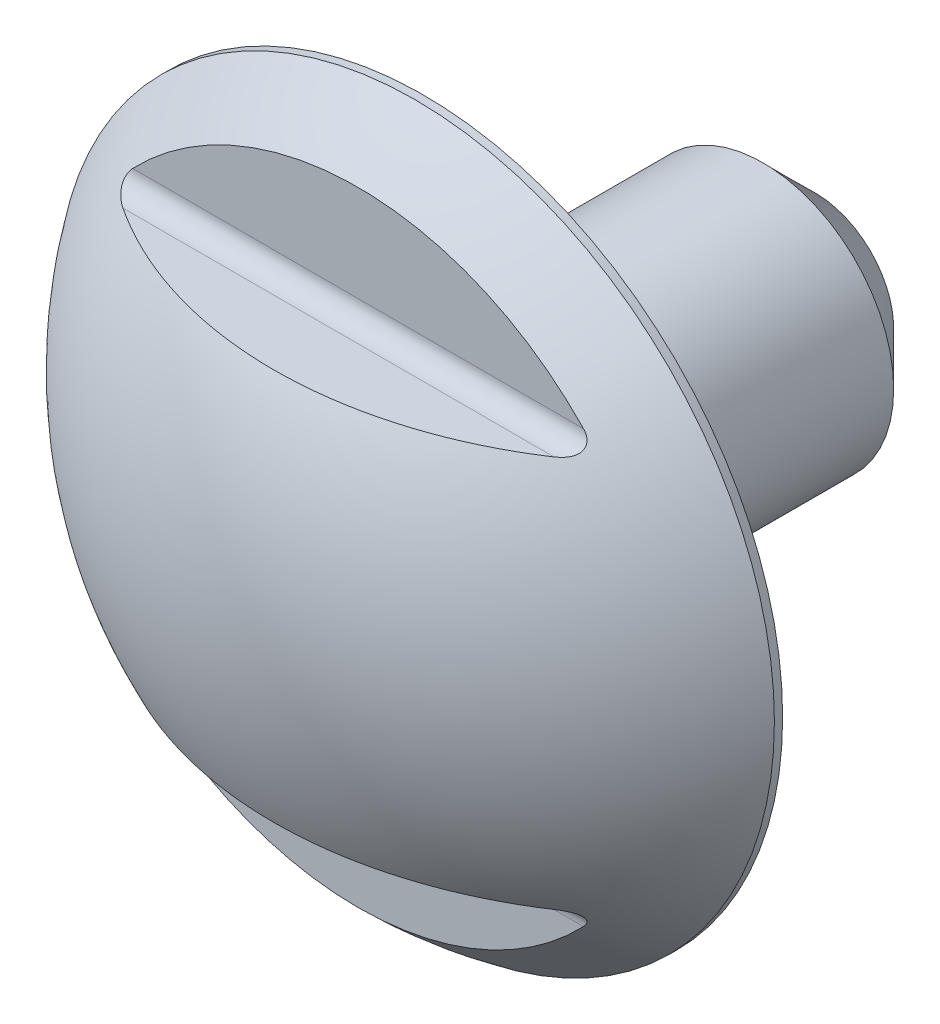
ISO-10303-21;
HEADER;
FILE_DESCRIPTION(('STEP AP214'),'2;1');
FILE_NAME('part.step','',(''),(''),'','','');
FILE_SCHEMA(('AUTOMOTIVE_DESIGN { 1 0 10303 214 1 1 1 1 }'));
ENDSEC;
DATA;
#1=APPLICATION_CONTEXT('core data for automotive mechanical design processes');
#2=APPLICATION_PROTOCOL_DEFINITION('international standard','automotive_design',2000,#1);
#3=PRODUCT_CONTEXT('',#1,'mechanical');
#4=PRODUCT('Part','Part','',(#3));
#5=PRODUCT_RELATED_PRODUCT_CATEGORY('part','',(#4));
#6=PRODUCT_DEFINITION_FORMATION('','',#4);
#7=PRODUCT_DEFINITION_CONTEXT('part definition',#1,'design');
#8=PRODUCT_DEFINITION('design','',#6,#7);
#9=PRODUCT_DEFINITION_SHAPE('','',#8);
#10=(LENGTH_UNIT() NAMED_UNIT(*) SI_UNIT(.MILLI.,.METRE.));
#11=(NAMED_UNIT(*) PLANE_ANGLE_UNIT() SI_UNIT($,.RADIAN.));
#12=(NAMED_UNIT(*) SI_UNIT($,.STERADIAN.) SOLID_ANGLE_UNIT());
#13=UNCERTAINTY_MEASURE_WITH_UNIT(LENGTH_MEASURE(1.E-05),#10,'distance_accuracy_value','');
#14=(GEOMETRIC_REPRESENTATION_CONTEXT(3) GLOBAL_UNCERTAINTY_ASSIGNED_CONTEXT((#13)) GLOBAL_UNIT_ASSIGNED_CONTEXT((#10,
#11,#12)) REPRESENTATION_CONTEXT('',''));
#15=CARTESIAN_POINT('',(0.,0.,0.));
#16=DIRECTION('',(0.,0.,1.));
#17=DIRECTION('',(1.,0.,0.));
#18=AXIS2_PLACEMENT_3D('',#15,#16,#17);
#19=CARTESIAN_POINT('',(0.,0.,-6.));
#20=DIRECTION('',(0.,0.,-1.));
#21=DIRECTION('',(1.,0.,0.));
#22=AXIS2_PLACEMENT_3D('',#19,#20,#21);
#23=CYLINDRICAL_SURFACE('',#22,5.5);
#24=CARTESIAN_POINT('',(0.,0.,0.));
#25=DIRECTION('',(0.,0.,-1.));
#26=DIRECTION('',(1.,0.,0.));
#27=AXIS2_PLACEMENT_3D('',#24,#25,#26);
#28=CIRCLE('',#27,5.5);
#29=CARTESIAN_POINT('',(5.5,0.,0.));
#30=VERTEX_POINT('',#29);
#31=EDGE_CURVE('E59',#30,#30,#28,.T.);
#32=ORIENTED_EDGE('',*,*,#31,.F.);
#33=EDGE_LOOP('',(#32));
#34=FACE_BOUND('',#33,.T.);
#35=CARTESIAN_POINT('',(0.,0.,0.126225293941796));
#36=DIRECTION('',(0.,0.,1.));
#37=DIRECTION('',(-1.,0.,0.));
#38=AXIS2_PLACEMENT_3D('',#35,#36,#37);
#39=CIRCLE('',#38,5.5);
#40=CARTESIAN_POINT('',(-5.5,0.,0.126225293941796));
#41=VERTEX_POINT('',#40);
#42=EDGE_CURVE('E176',#41,#41,#39,.T.);
#43=ORIENTED_EDGE('',*,*,#42,.F.);
#44=EDGE_LOOP('',(#43));
#45=FACE_BOUND('',#44,.T.);
#46=ADVANCED_FACE('F14',(#34,#45),#23,.T.);
#47=CARTESIAN_POINT('',(0.,-5.5,0.));
#48=DIRECTION('',(0.,0.,1.));
#49=DIRECTION('',(-1.,0.,0.));
#50=AXIS2_PLACEMENT_3D('',#47,#48,#49);
#51=PLANE('',#50);
#52=CARTESIAN_POINT('',(0.,0.,0.));
#53=DIRECTION('',(0.,0.,-1.));
#54=DIRECTION('',(1.,0.,0.));
#55=AXIS2_PLACEMENT_3D('',#52,#53,#54);
#56=CIRCLE('',#55,1.85);
#57=CARTESIAN_POINT('',(1.85,0.,0.));
#58=VERTEX_POINT('',#57);
#59=EDGE_CURVE('E195',#58,#58,#56,.T.);
#60=ORIENTED_EDGE('',*,*,#59,.F.);
#61=EDGE_LOOP('',(#60));
#62=FACE_BOUND('',#61,.T.);
#63=ORIENTED_EDGE('',*,*,#31,.T.);
#64=EDGE_LOOP('',(#63));
#65=FACE_BOUND('',#64,.T.);
#66=ADVANCED_FACE('F106',(#62,#65),#51,.F.);
#67=CARTESIAN_POINT('',(0.,0.,-0.4));
#68=DIRECTION('',(0.,0.,-1.));
#69=DIRECTION('',(1.,0.,0.));
#70=AXIS2_PLACEMENT_3D('',#67,#68,#69);
#71=TOROIDAL_SURFACE('',#70,1.85,0.4);
#72=CARTESIAN_POINT('',(0.,0.,-0.4));
#73=DIRECTION('',(0.,0.,-1.));
#74=DIRECTION('',(1.,0.,0.));
#75=AXIS2_PLACEMENT_3D('',#72,#73,#74);
#76=CIRCLE('',#75,1.45);
#77=CARTESIAN_POINT('',(1.45,0.,-0.4));
#78=VERTEX_POINT('',#77);
#79=EDGE_CURVE('E192',#78,#78,#76,.T.);
#80=ORIENTED_EDGE('',*,*,#79,.F.);
#81=EDGE_LOOP('',(#80));
#82=FACE_BOUND('',#81,.T.);
#83=ORIENTED_EDGE('',*,*,#59,.T.);
#84=EDGE_LOOP('',(#83));
#85=FACE_BOUND('',#84,.T.);
#86=ADVANCED_FACE('F111',(#82,#85),#71,.F.);
#87=CARTESIAN_POINT('',(0.,0.,-6.));
#88=DIRECTION('',(0.,0.,-1.));
#89=DIRECTION('',(1.,0.,0.));
#90=AXIS2_PLACEMENT_3D('',#87,#88,#89);
#91=CYLINDRICAL_SURFACE('',#90,1.45);
#92=CARTESIAN_POINT('',(0.,0.,-0.440192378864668));
#93=DIRECTION('',(0.,0.,-1.));
#94=DIRECTION('',(1.,0.,0.));
#95=AXIS2_PLACEMENT_3D('',#92,#93,#94);
#96=CIRCLE('',#95,1.45);
#97=CARTESIAN_POINT('',(1.45,0.,-0.440192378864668));
#98=VERTEX_POINT('',#97);
#99=EDGE_CURVE('E189',#98,#98,#96,.T.);
#100=ORIENTED_EDGE('',*,*,#99,.F.);
#101=EDGE_LOOP('',(#100));
#102=FACE_BOUND('',#101,.T.);
#103=ORIENTED_EDGE('',*,*,#79,.T.);
#104=EDGE_LOOP('',(#103));
#105=FACE_BOUND('',#104,.T.);
#106=ADVANCED_FACE('F119',(#102,#105),#91,.T.);
#107=CARTESIAN_POINT('',(0.,0.,-0.44019237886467));
#108=DIRECTION('',(0.,0.,-1.));
#109=DIRECTION('',(1.,0.,0.));
#110=AXIS2_PLACEMENT_3D('',#107,#108,#109);
#111=TOROIDAL_SURFACE('',#110,1.85,0.399999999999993);
#112=CARTESIAN_POINT('',(0.,0.,-0.640192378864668));
#113=DIRECTION('',(0.,0.,-1.));
#114=DIRECTION('',(1.,0.,0.));
#115=AXIS2_PLACEMENT_3D('',#112,#113,#114);
#116=CIRCLE('',#115,1.50358983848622);
#117=CARTESIAN_POINT('',(1.50358983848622,0.,-0.640192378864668));
#118=VERTEX_POINT('',#117);
#119=EDGE_CURVE('E186',#118,#118,#116,.T.);
#120=ORIENTED_EDGE('',*,*,#119,.F.);
#121=EDGE_LOOP('',(#120));
#122=FACE_BOUND('',#121,.T.);
#123=ORIENTED_EDGE('',*,*,#99,.T.);
#124=EDGE_LOOP('',(#123));
#125=FACE_BOUND('',#124,.T.);
#126=ADVANCED_FACE('F123',(#122,#125),#111,.F.);
#127=CARTESIAN_POINT('',(0.,0.,-0.640192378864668));
#128=DIRECTION('',(0.,0.,-1.));
#129=DIRECTION('',(1.,0.,0.));
#130=AXIS2_PLACEMENT_3D('',#127,#128,#129);
#131=CONICAL_SURFACE('',#130,1.50358983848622,0.523598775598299);
#132=CARTESIAN_POINT('',(0.,0.,-1.5));
#133=DIRECTION('',(0.,0.,-1.));
#134=DIRECTION('',(1.,0.,0.));
#135=AXIS2_PLACEMENT_3D('',#132,#133,#134);
#136=CIRCLE('',#135,2.);
#137=CARTESIAN_POINT('',(2.,0.,-1.5));
#138=VERTEX_POINT('',#137);
#139=EDGE_CURVE('E179',#138,#138,#136,.T.);
#140=ORIENTED_EDGE('',*,*,#139,.F.);
#141=EDGE_LOOP('',(#140));
#142=FACE_BOUND('',#141,.T.);
#143=ORIENTED_EDGE('',*,*,#119,.T.);
#144=EDGE_LOOP('',(#143));
#145=FACE_BOUND('',#144,.T.);
#146=ADVANCED_FACE('F127',(#142,#145),#131,.T.);
#147=CARTESIAN_POINT('',(0.,0.,-6.));
#148=DIRECTION('',(0.,0.,-1.));
#149=DIRECTION('',(1.,0.,0.));
#150=AXIS2_PLACEMENT_3D('',#147,#148,#149);
#151=CYLINDRICAL_SURFACE('',#150,2.);
#152=CARTESIAN_POINT('',(0.,0.,-5.2));
#153=DIRECTION('',(0.,0.,1.));
#154=DIRECTION('',(-1.,0.,0.));
#155=AXIS2_PLACEMENT_3D('',#152,#153,#154);
#156=CIRCLE('',#155,2.);
#157=CARTESIAN_POINT('',(-2.,0.,-5.2));
#158=VERTEX_POINT('',#157);
#159=EDGE_CURVE('E9',#158,#158,#156,.T.);
#160=ORIENTED_EDGE('',*,*,#159,.T.);
#161=EDGE_LOOP('',(#160));
#162=FACE_BOUND('',#161,.T.);
#163=ORIENTED_EDGE('',*,*,#139,.T.);
#164=EDGE_LOOP('',(#163));
#165=FACE_BOUND('',#164,.T.);
#166=ADVANCED_FACE('F131',(#162,#165),#151,.T.);
#167=CARTESIAN_POINT('',(0.,0.,-3.7));
#168=DIRECTION('',(0.,0.,1.));
#169=DIRECTION('',(0.,-1.,0.));
#170=AXIS2_PLACEMENT_3D('',#167,#168,#169);
#171=SPHERICAL_SURFACE('',#170,6.7);
#172=CARTESIAN_POINT('',(0.,3.,-3.7));
#173=DIRECTION('',(0.,-1.,0.));
#174=DIRECTION('',(0.,0.,1.));
#175=AXIS2_PLACEMENT_3D('',#172,#173,#174);
#176=CIRCLE('',#175,5.99082632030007);
#177=CARTESIAN_POINT('',(-3.3,3.,1.3));
#178=VERTEX_POINT('',#177);
#179=CARTESIAN_POINT('',(3.3,3.,1.3));
#180=VERTEX_POINT('',#179);
#181=EDGE_CURVE('E147',#178,#180,#176,.F.);
#182=ORIENTED_EDGE('',*,*,#181,.F.);
#183=CARTESIAN_POINT('',(-3.45089543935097,3.3002,1.00000006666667));
#184=CARTESIAN_POINT('',(-3.46018087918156,3.29048831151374,1.00000237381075));
#185=CARTESIAN_POINT('',(-3.46914612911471,3.28037875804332,1.00045993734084));
#186=CARTESIAN_POINT('',(-3.48611932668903,3.25927546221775,1.00258239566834));
#187=CARTESIAN_POINT('',(-3.49411182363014,3.24827117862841,1.0042643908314));
#188=CARTESIAN_POINT('',(-3.50706084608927,3.2278869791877,1.00865037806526));
#189=CARTESIAN_POINT('',(-3.51230406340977,3.21863403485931,1.01107565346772));
#190=CARTESIAN_POINT('',(-3.52144320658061,3.19986480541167,1.01703507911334));
#191=CARTESIAN_POINT('',(-3.52534582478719,3.19035009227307,1.0205635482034));
#192=CARTESIAN_POINT('',(-3.53092309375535,3.17302031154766,1.0280654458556));
#193=CARTESIAN_POINT('',(-3.53287341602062,3.16520988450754,1.03184218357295));
#194=CARTESIAN_POINT('',(-3.53549615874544,3.14978225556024,1.04017058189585));
#195=CARTESIAN_POINT('',(-3.53616853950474,3.1421650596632,1.04472226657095));
#196=CARTESIAN_POINT('',(-3.53617075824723,3.12736045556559,1.05449173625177));
#197=CARTESIAN_POINT('',(-3.53549939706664,3.12017343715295,1.05971011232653));
#198=CARTESIAN_POINT('',(-3.53287562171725,3.10643298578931,1.07063337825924));
#199=CARTESIAN_POINT('',(-3.53092247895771,3.09987991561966,1.07633854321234));
#200=CARTESIAN_POINT('',(-3.52529259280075,3.08604577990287,1.08944195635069));
#201=CARTESIAN_POINT('',(-3.52131606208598,3.07896325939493,1.0969197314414));
#202=CARTESIAN_POINT('',(-3.51201340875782,3.06596918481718,1.11203868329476));
#203=CARTESIAN_POINT('',(-3.50668549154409,3.06005920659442,1.11968006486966));
#204=CARTESIAN_POINT('',(-3.49206581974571,3.04659813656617,1.13880050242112));
#205=CARTESIAN_POINT('',(-3.48213266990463,3.03973031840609,1.1502644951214));
#206=CARTESIAN_POINT('',(-3.460749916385,3.02796447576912,1.1728760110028));
#207=CARTESIAN_POINT('',(-3.44929059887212,3.02307995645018,1.18402089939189));
#208=CARTESIAN_POINT('',(-3.42676990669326,3.0153950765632,1.20457526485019));
#209=CARTESIAN_POINT('',(-3.41581348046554,3.01241999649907,1.21403723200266));
#210=CARTESIAN_POINT('',(-3.39333574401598,3.00751675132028,1.23257885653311));
#211=CARTESIAN_POINT('',(-3.38181362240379,3.00559014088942,1.24165792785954));
#212=CARTESIAN_POINT('',(-3.35866326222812,3.00265798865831,1.25919687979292));
#213=CARTESIAN_POINT('',(-3.34704513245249,3.00163031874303,1.26766662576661));
#214=CARTESIAN_POINT('',(-3.32355151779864,3.00030227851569,1.28421487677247));
#215=CARTESIAN_POINT('',(-3.31167705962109,2.99999941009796,1.29229463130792));
#216=CARTESIAN_POINT('',(-3.29969688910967,3.00000006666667,1.3002));
#217=B_SPLINE_CURVE_WITH_KNOTS('',3,(#183,#184,#185,#186,#187,#188,#189,#190,#191,#192,#193,
#194,#195,#196,#197,#198,#199,#200,#201,#202,#203,#204,#205,#206,#207,#208,#209,#210,#211,#212,
#213,#214,#215,#216),.UNSPECIFIED.,.F.,.F.,(4,2,2,2,2,2,2,2,2,2,2,2,2,2,2,2,4),(0.,
0.0403974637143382,0.0813702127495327,0.113978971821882,0.146422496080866,0.172983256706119,
0.199544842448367,0.226130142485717,0.252730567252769,0.28566873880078,0.318650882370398,
0.368325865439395,0.418333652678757,0.462609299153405,0.506950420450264,0.550166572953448,
0.593233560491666),.UNSPECIFIED.);
#218=CARTESIAN_POINT('',(-3.45108678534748,3.3,1.));
#219=VERTEX_POINT('',#218);
#220=EDGE_CURVE('E157',#219,#178,#217,.T.);
#221=ORIENTED_EDGE('',*,*,#220,.F.);
#222=CARTESIAN_POINT('',(0.,0.,1.));
#223=DIRECTION('',(0.,0.,-1.));
#224=DIRECTION('',(0.,-1.,0.));
#225=AXIS2_PLACEMENT_3D('',#222,#223,#224);
#226=CIRCLE('',#225,4.77493455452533);
#227=CARTESIAN_POINT('',(3.45108678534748,3.3,1.));
#228=VERTEX_POINT('',#227);
#229=EDGE_CURVE('E73',#228,#219,#226,.F.);
#230=ORIENTED_EDGE('',*,*,#229,.F.);
#231=CARTESIAN_POINT('',(3.29969688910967,3.00000006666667,1.3002));
#232=CARTESIAN_POINT('',(3.31430711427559,3.00000454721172,1.29055614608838));
#233=CARTESIAN_POINT('',(3.32876926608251,3.00045317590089,1.28065091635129));
#234=CARTESIAN_POINT('',(3.35734920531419,3.00246823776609,1.26021193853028));
#235=CARTESIAN_POINT('',(3.37146290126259,3.00404436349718,1.24967347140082));
#236=CARTESIAN_POINT('',(3.39935085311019,3.00860290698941,1.22778339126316));
#237=CARTESIAN_POINT('',(3.41311009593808,3.01161648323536,1.21641873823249));
#238=CARTESIAN_POINT('',(3.43957104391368,3.01940778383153,1.19314330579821));
#239=CARTESIAN_POINT('',(3.45227673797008,3.02417844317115,1.18123487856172));
#240=CARTESIAN_POINT('',(3.47174047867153,3.03379937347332,1.1613999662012));
#241=CARTESIAN_POINT('',(3.47897095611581,3.03797889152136,1.15361468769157));
#242=CARTESIAN_POINT('',(3.49256263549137,3.0473758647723,1.13793714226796));
#243=CARTESIAN_POINT('',(3.49892598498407,3.05259067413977,1.1300451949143));
#244=CARTESIAN_POINT('',(3.51057224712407,3.06427793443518,1.11416825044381));
#245=CARTESIAN_POINT('',(3.51584074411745,3.07076521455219,1.1061833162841));
#246=CARTESIAN_POINT('',(3.52477894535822,3.08503547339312,1.09047194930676));
#247=CARTESIAN_POINT('',(3.52845172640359,3.09281591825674,1.08274504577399));
#248=CARTESIAN_POINT('',(3.53315073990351,3.10756914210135,1.06968936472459));
#249=CARTESIAN_POINT('',(3.53459973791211,3.11429041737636,1.06422885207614));
#250=CARTESIAN_POINT('',(3.53621492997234,3.1282846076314,1.05385062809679));
#251=CARTESIAN_POINT('',(3.53638173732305,3.13555725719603,1.04893265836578));
#252=CARTESIAN_POINT('',(3.53541714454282,3.15043972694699,1.03979236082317));
#253=CARTESIAN_POINT('',(3.53428616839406,3.15804943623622,1.03556980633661));
#254=CARTESIAN_POINT('',(3.5308278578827,3.17337877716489,1.02789576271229));
#255=CARTESIAN_POINT('',(3.52850021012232,3.18109843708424,1.02444447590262));
#256=CARTESIAN_POINT('',(3.52190588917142,3.19892583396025,1.01732823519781));
#257=CARTESIAN_POINT('',(3.51725673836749,3.20900531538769,1.01394983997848));
#258=CARTESIAN_POINT('',(3.50657915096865,3.22879085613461,1.0083911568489));
#259=CARTESIAN_POINT('',(3.50054441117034,3.23849496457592,1.00621650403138));
#260=CARTESIAN_POINT('',(3.48758435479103,3.25721720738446,1.00291628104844));
#261=CARTESIAN_POINT('',(3.48067533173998,3.26624400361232,1.00177403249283));
#262=CARTESIAN_POINT('',(3.46621678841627,3.28366499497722,1.0003205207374));
#263=CARTESIAN_POINT('',(3.45867581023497,3.29206540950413,0.999999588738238));
#264=CARTESIAN_POINT('',(3.45089543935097,3.3002,1.00000006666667));
#265=B_SPLINE_CURVE_WITH_KNOTS('',3,(#231,#232,#233,#234,#235,#236,#237,#238,#239,#240,#241,
#242,#243,#244,#245,#246,#247,#248,#249,#250,#251,#252,#253,#254,#255,#256,#257,#258,#259,#260,
#261,#262,#263,#264),.UNSPECIFIED.,.F.,.F.,(4,2,2,2,2,2,2,2,2,2,2,2,2,2,2,2,4),(0.,
0.0525412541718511,0.105539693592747,0.15974309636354,0.213730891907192,0.247920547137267,
0.28202392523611,0.316551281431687,0.351011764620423,0.377234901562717,0.403445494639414,
0.429647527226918,0.455856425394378,0.490472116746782,0.525248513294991,0.55945250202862,
0.593251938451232),.UNSPECIFIED.);
#266=EDGE_CURVE('E148',#180,#228,#265,.T.);
#267=ORIENTED_EDGE('',*,*,#266,.F.);
#268=EDGE_LOOP('',(#182,#221,#230,#267));
#269=FACE_BOUND('',#268,.T.);
#270=CARTESIAN_POINT('',(0.,0.,1.));
#271=DIRECTION('',(0.,0.,-1.));
#272=DIRECTION('',(0.,-1.,0.));
#273=AXIS2_PLACEMENT_3D('',#270,#271,#272);
#274=CIRCLE('',#273,4.77493455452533);
#275=CARTESIAN_POINT('',(-3.4510867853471,-3.3,1.));
#276=VERTEX_POINT('',#275);
#277=CARTESIAN_POINT('',(3.45108678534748,-3.3,1.));
#278=VERTEX_POINT('',#277);
#279=EDGE_CURVE('E71',#276,#278,#274,.F.);
#280=ORIENTED_EDGE('',*,*,#279,.F.);
#281=CARTESIAN_POINT('',(-3.29969688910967,-3.00000006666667,1.3002));
#282=CARTESIAN_POINT('',(-3.31430711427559,-3.00000454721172,1.29055614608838));
#283=CARTESIAN_POINT('',(-3.32876926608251,-3.00045317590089,1.2806509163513));
#284=CARTESIAN_POINT('',(-3.35734920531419,-3.00246823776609,1.26021193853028));
#285=CARTESIAN_POINT('',(-3.37146290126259,-3.00404436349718,1.24967347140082));
#286=CARTESIAN_POINT('',(-3.39935085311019,-3.00860290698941,1.22778339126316));
#287=CARTESIAN_POINT('',(-3.41311009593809,-3.01161648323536,1.21641873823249));
#288=CARTESIAN_POINT('',(-3.43957104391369,-3.01940778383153,1.1931433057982));
#289=CARTESIAN_POINT('',(-3.45227673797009,-3.02417844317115,1.18123487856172));
#290=CARTESIAN_POINT('',(-3.47174047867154,-3.03379937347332,1.16139996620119));
#291=CARTESIAN_POINT('',(-3.47897095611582,-3.03797889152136,1.15361468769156));
#292=CARTESIAN_POINT('',(-3.49256263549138,-3.04737586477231,1.13793714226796));
#293=CARTESIAN_POINT('',(-3.49892598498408,-3.05259067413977,1.1300451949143));
#294=CARTESIAN_POINT('',(-3.51057224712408,-3.06427793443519,1.1141682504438));
#295=CARTESIAN_POINT('',(-3.51584074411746,-3.07076521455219,1.10618331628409));
#296=CARTESIAN_POINT('',(-3.52477894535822,-3.08503547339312,1.09047194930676));
#297=CARTESIAN_POINT('',(-3.5284517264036,-3.09281591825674,1.08274504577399));
#298=CARTESIAN_POINT('',(-3.53315073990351,-3.10756914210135,1.06968936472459));
#299=CARTESIAN_POINT('',(-3.53459973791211,-3.11429041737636,1.06422885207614));
#300=CARTESIAN_POINT('',(-3.53621492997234,-3.1282846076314,1.05385062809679));
#301=CARTESIAN_POINT('',(-3.53638173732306,-3.13555725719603,1.04893265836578));
#302=CARTESIAN_POINT('',(-3.53541714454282,-3.150439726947,1.03979236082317));
#303=CARTESIAN_POINT('',(-3.53428616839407,-3.15804943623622,1.03556980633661));
#304=CARTESIAN_POINT('',(-3.5308278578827,-3.17337877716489,1.02789576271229));
#305=CARTESIAN_POINT('',(-3.52850021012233,-3.18109843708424,1.02444447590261));
#306=CARTESIAN_POINT('',(-3.52190588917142,-3.19892583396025,1.0173282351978));
#307=CARTESIAN_POINT('',(-3.5172567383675,-3.20900531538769,1.01394983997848));
#308=CARTESIAN_POINT('',(-3.50657915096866,-3.22879085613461,1.0083911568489));
#309=CARTESIAN_POINT('',(-3.50054441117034,-3.23849496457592,1.00621650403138));
#310=CARTESIAN_POINT('',(-3.48758435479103,-3.25721720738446,1.00291628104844));
#311=CARTESIAN_POINT('',(-3.48067533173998,-3.26624400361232,1.00177403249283));
#312=CARTESIAN_POINT('',(-3.46621678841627,-3.28366499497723,1.0003205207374));
#313=CARTESIAN_POINT('',(-3.45867581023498,-3.29206540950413,0.999999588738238));
#314=CARTESIAN_POINT('',(-3.45089543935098,-3.3002,1.00000006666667));
#315=B_SPLINE_CURVE_WITH_KNOTS('',3,(#281,#282,#283,#284,#285,#286,#287,#288,#289,#290,#291,
#292,#293,#294,#295,#296,#297,#298,#299,#300,#301,#302,#303,#304,#305,#306,#307,#308,#309,#310,
#311,#312,#313,#314),.UNSPECIFIED.,.F.,.F.,(4,2,2,2,2,2,2,2,2,2,2,2,2,2,2,2,4),(0.,
0.0525412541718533,0.105539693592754,0.159743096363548,0.213730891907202,0.247920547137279,
0.282023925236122,0.316551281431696,0.351011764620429,0.377234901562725,0.403445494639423,
0.429647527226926,0.455856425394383,0.490472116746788,0.525248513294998,0.559452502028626,
0.593251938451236),.UNSPECIFIED.);
#316=CARTESIAN_POINT('',(-3.3,-3.,1.3));
#317=VERTEX_POINT('',#316);
#318=EDGE_CURVE('E64',#317,#276,#315,.T.);
#319=ORIENTED_EDGE('',*,*,#318,.F.);
#320=CARTESIAN_POINT('',(0.,-3.,-3.7));
#321=DIRECTION('',(0.,1.,0.));
#322=DIRECTION('',(0.,0.,-1.));
#323=AXIS2_PLACEMENT_3D('',#320,#321,#322);
#324=CIRCLE('',#323,5.99082632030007);
#325=CARTESIAN_POINT('',(3.3,-3.,1.3));
#326=VERTEX_POINT('',#325);
#327=EDGE_CURVE('E53',#326,#317,#324,.F.);
#328=ORIENTED_EDGE('',*,*,#327,.F.);
#329=CARTESIAN_POINT('',(3.45089543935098,-3.3002,1.00000006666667));
#330=CARTESIAN_POINT('',(3.46018087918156,-3.29048831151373,1.00000237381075));
#331=CARTESIAN_POINT('',(3.46914612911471,-3.28037875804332,1.00045993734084));
#332=CARTESIAN_POINT('',(3.48611932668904,-3.25927546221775,1.00258239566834));
#333=CARTESIAN_POINT('',(3.49411182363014,-3.24827117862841,1.0042643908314));
#334=CARTESIAN_POINT('',(3.50706084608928,-3.2278869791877,1.00865037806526));
#335=CARTESIAN_POINT('',(3.51230406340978,-3.21863403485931,1.01107565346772));
#336=CARTESIAN_POINT('',(3.52144320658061,-3.19986480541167,1.01703507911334));
#337=CARTESIAN_POINT('',(3.52534582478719,-3.19035009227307,1.0205635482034));
#338=CARTESIAN_POINT('',(3.53092309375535,-3.17302031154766,1.0280654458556));
#339=CARTESIAN_POINT('',(3.53287341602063,-3.16520988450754,1.03184218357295));
#340=CARTESIAN_POINT('',(3.53549615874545,-3.14978225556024,1.04017058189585));
#341=CARTESIAN_POINT('',(3.53616853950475,-3.14216505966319,1.04472226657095));
#342=CARTESIAN_POINT('',(3.53617075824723,-3.12736045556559,1.05449173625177));
#343=CARTESIAN_POINT('',(3.53549939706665,-3.12017343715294,1.05971011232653));
#344=CARTESIAN_POINT('',(3.53287562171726,-3.10643298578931,1.07063337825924));
#345=CARTESIAN_POINT('',(3.53092247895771,-3.09987991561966,1.07633854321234));
#346=CARTESIAN_POINT('',(3.52529259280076,-3.08604577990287,1.08944195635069));
#347=CARTESIAN_POINT('',(3.52131606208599,-3.07896325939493,1.0969197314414));
#348=CARTESIAN_POINT('',(3.51201340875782,-3.06596918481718,1.11203868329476));
#349=CARTESIAN_POINT('',(3.50668549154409,-3.06005920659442,1.11968006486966));
#350=CARTESIAN_POINT('',(3.49206581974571,-3.04659813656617,1.13880050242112));
#351=CARTESIAN_POINT('',(3.48213266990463,-3.03973031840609,1.1502644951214));
#352=CARTESIAN_POINT('',(3.460749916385,-3.02796447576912,1.1728760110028));
#353=CARTESIAN_POINT('',(3.44929059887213,-3.02307995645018,1.18402089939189));
#354=CARTESIAN_POINT('',(3.42676990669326,-3.0153950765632,1.20457526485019));
#355=CARTESIAN_POINT('',(3.41581348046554,-3.01241999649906,1.21403723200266));
#356=CARTESIAN_POINT('',(3.39333574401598,-3.00751675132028,1.23257885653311));
#357=CARTESIAN_POINT('',(3.38181362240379,-3.00559014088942,1.24165792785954));
#358=CARTESIAN_POINT('',(3.35866326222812,-3.00265798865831,1.25919687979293));
#359=CARTESIAN_POINT('',(3.34704513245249,-3.00163031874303,1.26766662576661));
#360=CARTESIAN_POINT('',(3.32355151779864,-3.00030227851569,1.28421487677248));
#361=CARTESIAN_POINT('',(3.31167705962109,-2.99999941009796,1.29229463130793));
#362=CARTESIAN_POINT('',(3.29969688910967,-3.00000006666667,1.3002));
#363=B_SPLINE_CURVE_WITH_KNOTS('',3,(#329,#330,#331,#332,#333,#334,#335,#336,#337,#338,#339,
#340,#341,#342,#343,#344,#345,#346,#347,#348,#349,#350,#351,#352,#353,#354,#355,#356,#357,#358,
#359,#360,#361,#362),.UNSPECIFIED.,.F.,.F.,(4,2,2,2,2,2,2,2,2,2,2,2,2,2,2,2,4),(0.,
0.0403974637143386,0.0813702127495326,0.113978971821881,0.146422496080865,0.172983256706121,
0.199544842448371,0.226130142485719,0.252730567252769,0.28566873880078,0.318650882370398,
0.368325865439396,0.418333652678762,0.46260929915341,0.506950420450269,0.550166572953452,
0.593233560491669),.UNSPECIFIED.);
#364=EDGE_CURVE('E58',#278,#326,#363,.T.);
#365=ORIENTED_EDGE('',*,*,#364,.F.);
#366=EDGE_LOOP('',(#280,#319,#328,#365));
#367=FACE_BOUND('',#366,.T.);
#368=ORIENTED_EDGE('',*,*,#42,.T.);
#369=EDGE_LOOP('',(#368));
#370=FACE_BOUND('',#369,.T.);
#371=ADVANCED_FACE('F69',(#269,#367,#370),#171,.T.);
#372=CARTESIAN_POINT('',(10.,-3.3,1.));
#373=DIRECTION('',(0.,0.,-1.));
#374=DIRECTION('',(0.,-1.,0.));
#375=AXIS2_PLACEMENT_3D('',#372,#373,#374);
#376=PLANE('',#375);
#377=ORIENTED_EDGE('',*,*,#279,.T.);
#378=DIRECTION('',(-1.,0.,0.));
#379=VECTOR('',#378,1.);
#380=CARTESIAN_POINT('',(10.,-3.3,1.));
#381=LINE('',#380,#379);
#382=EDGE_CURVE('E66',#278,#276,#381,.T.);
#383=ORIENTED_EDGE('',*,*,#382,.T.);
#384=EDGE_LOOP('',(#377,#383));
#385=FACE_BOUND('',#384,.T.);
#386=ADVANCED_FACE('F93',(#385),#376,.F.);
#387=CARTESIAN_POINT('',(10.,-3.3,1.3));
#388=DIRECTION('',(-1.,0.,0.));
#389=DIRECTION('',(0.,-1.,0.));
#390=AXIS2_PLACEMENT_3D('',#387,#388,#389);
#391=CYLINDRICAL_SURFACE('',#390,0.3);
#392=ORIENTED_EDGE('',*,*,#318,.T.);
#393=ORIENTED_EDGE('',*,*,#382,.F.);
#394=ORIENTED_EDGE('',*,*,#364,.T.);
#395=DIRECTION('',(-1.,0.,0.));
#396=VECTOR('',#395,1.);
#397=CARTESIAN_POINT('',(10.,-3.,1.3));
#398=LINE('',#397,#396);
#399=EDGE_CURVE('E35',#326,#317,#398,.T.);
#400=ORIENTED_EDGE('',*,*,#399,.T.);
#401=EDGE_LOOP('',(#392,#393,#394,#400));
#402=FACE_BOUND('',#401,.T.);
#403=ADVANCED_FACE('F62',(#402),#391,.F.);
#404=CARTESIAN_POINT('',(10.,-3.,3.28679754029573));
#405=DIRECTION('',(0.,1.,0.));
#406=DIRECTION('',(0.,0.,-1.));
#407=AXIS2_PLACEMENT_3D('',#404,#405,#406);
#408=PLANE('',#407);
#409=ORIENTED_EDGE('',*,*,#327,.T.);
#410=ORIENTED_EDGE('',*,*,#399,.F.);
#411=EDGE_LOOP('',(#409,#410));
#412=FACE_BOUND('',#411,.T.);
#413=ADVANCED_FACE('F54',(#412),#408,.F.);
#414=CARTESIAN_POINT('',(10.,3.,3.28679754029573));
#415=DIRECTION('',(0.,-1.,0.));
#416=DIRECTION('',(0.,0.,1.));
#417=AXIS2_PLACEMENT_3D('',#414,#415,#416);
#418=PLANE('',#417);
#419=ORIENTED_EDGE('',*,*,#181,.T.);
#420=DIRECTION('',(-1.,0.,0.));
#421=VECTOR('',#420,1.);
#422=CARTESIAN_POINT('',(10.,3.,1.3));
#423=LINE('',#422,#421);
#424=EDGE_CURVE('E173',#180,#178,#423,.T.);
#425=ORIENTED_EDGE('',*,*,#424,.T.);
#426=EDGE_LOOP('',(#419,#425));
#427=FACE_BOUND('',#426,.T.);
#428=ADVANCED_FACE('F97',(#427),#418,.F.);
#429=CARTESIAN_POINT('',(10.,3.3,1.3));
#430=DIRECTION('',(-1.,0.,0.));
#431=DIRECTION('',(0.,-1.,0.));
#432=AXIS2_PLACEMENT_3D('',#429,#430,#431);
#433=CYLINDRICAL_SURFACE('',#432,0.3);
#434=ORIENTED_EDGE('',*,*,#266,.T.);
#435=DIRECTION('',(-1.,0.,0.));
#436=VECTOR('',#435,1.);
#437=CARTESIAN_POINT('',(10.,3.3,1.));
#438=LINE('',#437,#436);
#439=EDGE_CURVE('E28',#228,#219,#438,.T.);
#440=ORIENTED_EDGE('',*,*,#439,.T.);
#441=ORIENTED_EDGE('',*,*,#220,.T.);
#442=ORIENTED_EDGE('',*,*,#424,.F.);
#443=EDGE_LOOP('',(#434,#440,#441,#442));
#444=FACE_BOUND('',#443,.T.);
#445=ADVANCED_FACE('F102',(#444),#433,.F.);
#446=CARTESIAN_POINT('',(10.,3.3,1.));
#447=DIRECTION('',(0.,0.,-1.));
#448=DIRECTION('',(0.,-1.,0.));
#449=AXIS2_PLACEMENT_3D('',#446,#447,#448);
#450=PLANE('',#449);
#451=ORIENTED_EDGE('',*,*,#229,.T.);
#452=ORIENTED_EDGE('',*,*,#439,.F.);
#453=EDGE_LOOP('',(#451,#452));
#454=FACE_BOUND('',#453,.T.);
#455=ADVANCED_FACE('F137',(#454),#450,.F.);
#456=CARTESIAN_POINT('',(0.,-1.5705,-6.));
#457=DIRECTION('',(0.,0.,1.));
#458=DIRECTION('',(-1.,0.,0.));
#459=AXIS2_PLACEMENT_3D('',#456,#457,#458);
#460=PLANE('',#459);
#461=CARTESIAN_POINT('',(0.,0.,-6.));
#462=DIRECTION('',(0.,0.,1.));
#463=DIRECTION('',(-1.,0.,0.));
#464=AXIS2_PLACEMENT_3D('',#461,#462,#463);
#465=CIRCLE('',#464,1.2);
#466=CARTESIAN_POINT('',(-1.2,0.,-6.));
#467=VERTEX_POINT('',#466);
#468=EDGE_CURVE('E22',#467,#467,#465,.F.);
#469=ORIENTED_EDGE('',*,*,#468,.T.);
#470=EDGE_LOOP('',(#469));
#471=FACE_BOUND('',#470,.T.);
#472=ADVANCED_FACE('F135',(#471),#460,.F.);
#473=CARTESIAN_POINT('',(0.,0.,-6.));
#474=DIRECTION('',(0.,0.,1.));
#475=DIRECTION('',(-1.,0.,0.));
#476=AXIS2_PLACEMENT_3D('',#473,#474,#475);
#477=CONICAL_SURFACE('',#476,1.2,0.785398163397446);
#478=ORIENTED_EDGE('',*,*,#159,.F.);
#479=EDGE_LOOP('',(#478));
#480=FACE_BOUND('',#479,.T.);
#481=ORIENTED_EDGE('',*,*,#468,.F.);
#482=EDGE_LOOP('',(#481));
#483=FACE_BOUND('',#482,.T.);
#484=ADVANCED_FACE('F16',(#480,#483),#477,.T.);
#485=CLOSED_SHELL('',(#46,#66,#86,#106,#126,#146,#166,#371,#386,#403,#413,#428,#445,#455,#472,#484));
#486=MANIFOLD_SOLID_BREP('B1',#485);
#487=ADVANCED_BREP_SHAPE_REPRESENTATION('',(#18,#486),#14);
#488=SHAPE_DEFINITION_REPRESENTATION(#9,#487);
ENDSEC;
END-ISO-10303-21;
